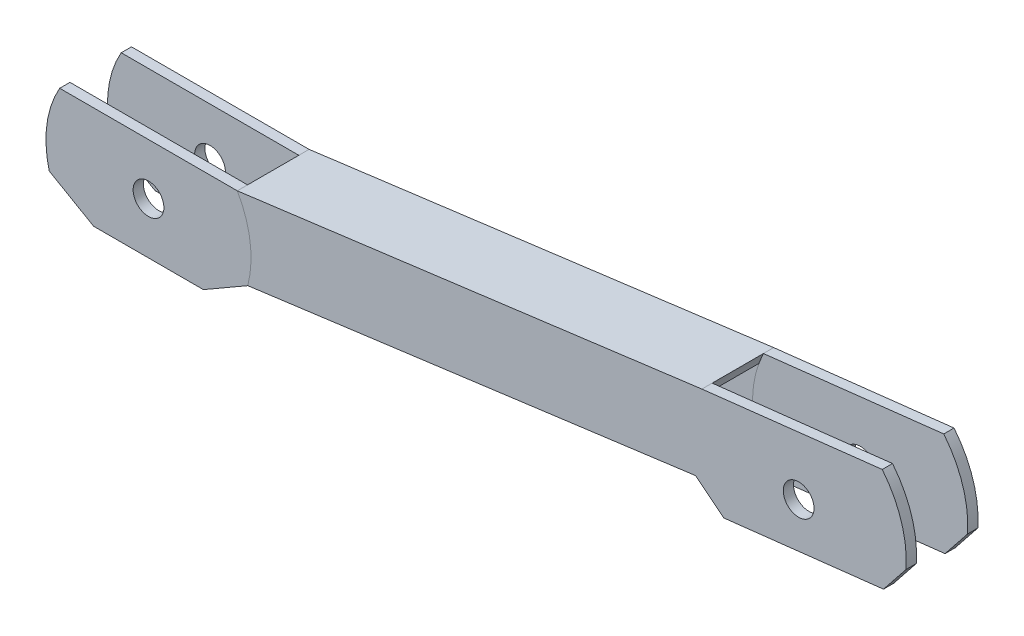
from build123d import *

# Parameters (mm, degrees)
ESQUISSE2_R             = 15
BOSS_EXTRU_1_DEPTH      = 35
ENL_V_MAT_EXTRU_1_DEPTH = 25
ESQUISSE4_R             = 15
BOSS_EXTRU_2_DEPTH      = 35
ENL_V_MAT_EXTRU_2_DEPTH = 25
BOSS_EXTRU_4_DEPTH      = 35
BOSS_EXTRU_5_DEPTH      = 10


with BuildPart() as part:
    # Esquisse2 → Boss.-Extru.1 (new, symmetric)
    with BuildSketch(Plane.XY):
        with BuildLine():
            Line((-86.602540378, 50), (86.602540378, 50))
            ThreePointArc((86.602540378, 50), (99.083941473, 13.504537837), (96.824583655, -25))
            Line((96.824583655, -25), (53.523313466, -50))
            Line((53.523313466, -50), (-53.523313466, -50))
            Line((-53.523313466, -50), (-96.824583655, -25))
            ThreePointArc((-96.824583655, -25), (-99.083941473, 13.504537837), (-86.602540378, 50))
        make_face()
        Circle(ESQUISSE2_R, mode=Mode.SUBTRACT)
    extrude(amount=BOSS_EXTRU_1_DEPTH, both=True)

    # Esquisse3 → Enl_v. mat.-Extru.1 (cut, symmetric)
    with BuildSketch(Plane.XY):
        with BuildLine():
            Line((-96.824583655, -25), (-53.523313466, -50))
            Line((-53.523313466, -50), (53.523313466, -50))
            Line((53.523313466, -50), (96.824583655, -25))
            ThreePointArc((96.824583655, -25), (99.083941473, 13.504537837), (86.602540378, 50))
            Line((86.602540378, 50), (-86.602540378, 50))
            ThreePointArc((-86.602540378, 50), (-99.083941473, 13.504537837), (-96.824583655, -25))
        make_face()
    extrude(amount=ENL_V_MAT_EXTRU_1_DEPTH, both=True, mode=Mode.SUBTRACT)


with BuildPart() as enl_v_mat_extru_1_piece_1:
    # of the separate pieces the step leaves, piece 1, a body of its own (enl_v_mat_extru_1_pieces)
    add(part.part.solids().sort_by_distance((-86.602540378, 50, 25))[0])


with BuildPart() as enl_v_mat_extru_1_piece_2:
    # of the separate pieces the step leaves, piece 2, a body of its own (enl_v_mat_extru_1_pieces)
    add(part.part.solids().sort_by_distance((-86.602540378, 50, -35))[0])



with BuildPart() as body_3:
    # Esquisse4 → Boss.-Extru.2 (new, symmetric)
    with BuildSketch(Plane.XY):
        with BuildLine():
            Line((539.670102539, 109.118005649), (715.537934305, 129.155614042))
            ThreePointArc((715.537934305, 129.155614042), (734.02774949, 94.928816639), (738.78725291, 56.319309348))
            Line((738.78725291, 56.319309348), (716.778036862, 28.649932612))
            Line((716.778036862, 28.649932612), (561.070642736, 10.909315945))
            Line((561.070642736, 10.909315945), (533.401265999, 32.918531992))
            ThreePointArc((533.401265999, 32.918531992), (529.353534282, 71.609135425), (539.670102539, 109.118005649))
        make_face()
        with Locations((634, 63)):
            Circle(ESQUISSE4_R, mode=Mode.SUBTRACT)
    extrude(amount=BOSS_EXTRU_2_DEPTH, both=True)

    # Esquisse5 → Enl_v. mat.-Extru.2 (cut, symmetric)
    with BuildSketch(Plane.XY):
        with BuildLine():
            Line((716.778036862, 28.649932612), (738.78725291, 56.319309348))
            ThreePointArc((738.78725291, 56.319309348), (734.02774949, 94.928816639), (715.537934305, 129.155614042))
            Line((715.537934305, 129.155614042), (539.670102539, 109.118005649))
            ThreePointArc((539.670102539, 109.118005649), (529.353534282, 71.609135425), (533.401265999, 32.918531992))
            Line((533.401265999, 32.918531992), (561.070642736, 10.909315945))
            Line((561.070642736, 10.909315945), (716.778036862, 28.649932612))
        make_face()
    extrude(amount=ENL_V_MAT_EXTRU_2_DEPTH, both=True, mode=Mode.SUBTRACT)


with BuildPart() as enl_v_mat_extru_2_piece_1:
    # of the separate pieces the step leaves, piece 1, a body of its own (enl_v_mat_extru_2_pieces)
    add(body_3.part.solids().sort_by_distance((533.401265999, 32.918531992, -35))[0])


with BuildPart() as enl_v_mat_extru_2_piece_2:
    # of the separate pieces the step leaves, piece 2, a body of its own (enl_v_mat_extru_2_pieces)
    add(body_3.part.solids().sort_by_distance((533.401265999, 32.918531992, 25))[0])


with BuildPart() as enl_v_mat_extru_1_piece_2_1:
    add(enl_v_mat_extru_1_piece_2.part)

    add(enl_v_mat_extru_2_piece_2.part)  # Boss.-Extru.4 merges Enl_v. mat.-Extru.2 piece 2
    # Esquisse6 → Boss.-Extru.4 (add, symmetric)
    with BuildSketch(Plane.XY):
        with BuildLine():
            Line((86.602540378, 50), (539.670102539, 109.118005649))
            ThreePointArc((539.670102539, 109.118005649), (537.269532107, 103.843807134), (535.163583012, 98.445206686))
            Line((535.163583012, 98.445206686), (91.412665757, 40.542872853))
            ThreePointArc((91.412665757, 40.542872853), (89.13311796, 45.33527636), (86.602540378, 50))
        make_face()
    extrude(amount=BOSS_EXTRU_4_DEPTH, both=True)

    # Esquisse7 → Boss.-Extru.5 (add)
    with BuildSketch(Plane.XY.offset(35)):
        with BuildLine():
            Line((86.602540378, 50), (539.670102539, 109.118005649))
            ThreePointArc((539.670102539, 109.118005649), (529.353534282, 71.609135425), (533.401265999, 32.918531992))
            Line((533.401265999, 32.918531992), (96.824583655, -25))
            ThreePointArc((96.824583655, -25), (99.083941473, 13.504537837), (86.602540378, 50))
        make_face()
    boss_extru_5 = extrude(amount=-BOSS_EXTRU_5_DEPTH)

    # Sym_trie1: Boss.-Extru.5 across plane
    add(boss_extru_5.mirror(Plane.XY))


solid = Compound([enl_v_mat_extru_1_piece_1.part, enl_v_mat_extru_2_piece_1.part, enl_v_mat_extru_1_piece_2_1.part])
